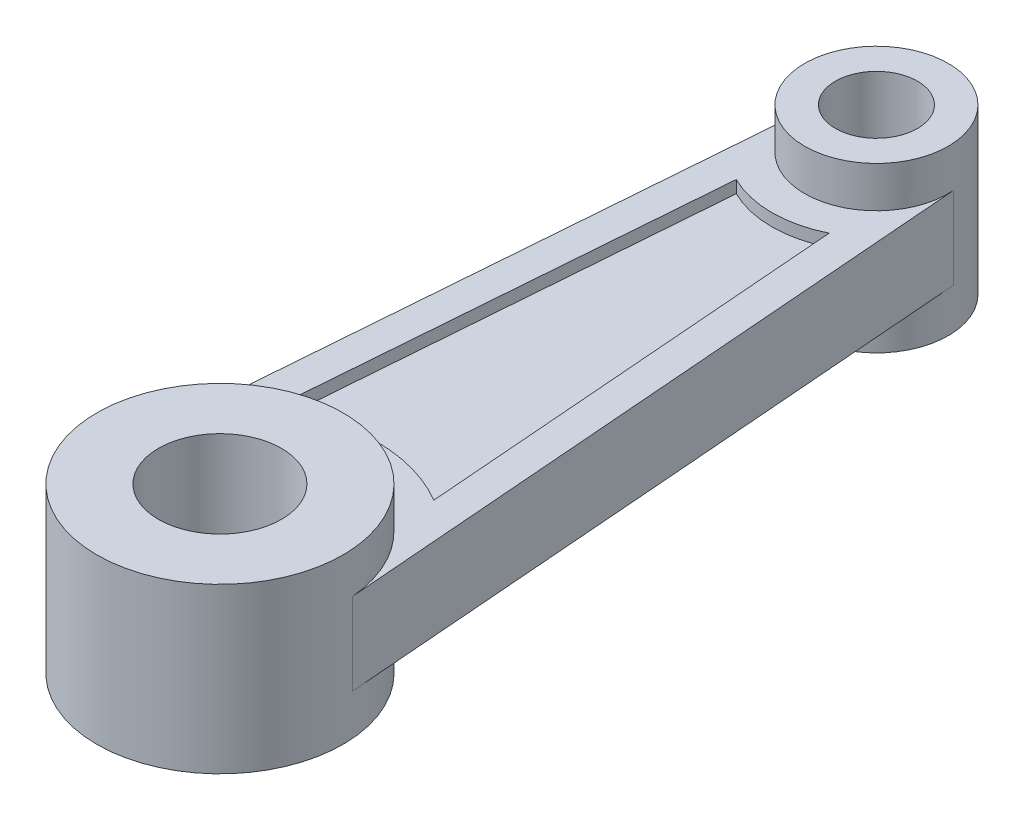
from build123d import *

# Parameters (mm, degrees)
CROQUIS1_R       = 30
CROQUIS1_R_2     = 15
EXTRUIR1_DEPTH   = 20
CROQUIS1_R_3     = 17.5
EXTRUIR1_2_DEPTH = 20
EXTRUIR2_DEPTH   = 10
CROQUIS2_R       = 10
EXTRUIR3_DEPTH   = 185.407836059
EXTRUIR4_DEPTH   = 3


with BuildPart() as part:
    # Croquis1 → Extruir1 (new, symmetric)
    with BuildSketch(Plane(origin=(0, 0, 0), x_dir=(1, 0, 0), z_dir=(0, 1, 0))):
        with Locations(Location((0, 0, 0), (0, 0, 270))):
            Circle(CROQUIS1_R)
        with Locations(Location((0, 0, 0), (0, 0, 270))):
            Circle(CROQUIS1_R_2, mode=Mode.SUBTRACT)
    extrude(amount=EXTRUIR1_DEPTH, both=True)



with BuildPart() as body_2:
    # Croquis1 → Extruir1 2 (new, symmetric)
    with BuildSketch(Plane(origin=(0, 0, 0), x_dir=(1, 0, 0), z_dir=(0, 1, 0))):
        with Locations(Location((0, 160, 0), (0, 0, 270))):
            Circle(CROQUIS1_R_3)
    extrude(amount=EXTRUIR1_2_DEPTH, both=True)


with BuildPart() as part_1:
    add(part.part)

    add(body_2.part)  # Extruir2 merges body 2
    # Croquis1_3 → Extruir2 (add, symmetric)
    with BuildSketch(Plane(origin=(0, 0, 0), x_dir=(1, 0, 0), z_dir=(0, 1, 0))):
        with BuildLine():
            Line((29.908307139, 2.34375), (17.446512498, 161.3671875))
            ThreePointArc((17.446512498, 161.3671875), (17.486623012, 160.684116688), (17.5, 160))
            ThreePointArc((17.5, 160), (12.374368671, 147.625631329), (0, 142.5))
            Line((0, 142.5), (0, 30))
            ThreePointArc((0, 30), (20.367713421, 22.026262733), (29.908307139, 2.34375))
        make_face()
        with BuildLine():
            ThreePointArc((0, 142.5), (-12.848653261, 148.118833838), (-17.446512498, 161.3671875))
            Line((-17.446512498, 161.3671875), (-29.908307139, 2.34375))
            ThreePointArc((-29.908307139, 2.34375), (-20.367713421, 22.026262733), (0, 30))
            Line((0, 30), (0, 142.5))
        make_face()
    extrude(amount=EXTRUIR2_DEPTH, both=True)

    # Croquis2 → Extruir3 (cut, through all)
    with BuildSketch(Plane(origin=(0, 20, 0), x_dir=(1, 0, 0), z_dir=(0, 1, 0))):
        with Locations(Location((0, 160, 0), (0, 0, 270))):
            Circle(CROQUIS2_R)
    extrude(amount=-EXTRUIR3_DEPTH, mode=Mode.SUBTRACT)

    # Croquis3 → Extruir4 (cut)
    with BuildSketch(Plane(origin=(0, 10, 0), x_dir=(1, 0, 0), z_dir=(0, 1, 0))):
        with BuildLine():
            Line((-11.31973886, 137.150196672), (-19.512143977, 32.60791679))
            ThreePointArc((-19.512143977, 32.60791679), (0, 38), (19.512143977, 32.60791679))
            Line((19.512143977, 32.60791679), (11.31973886, 137.150196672))
            ThreePointArc((11.31973886, 137.150196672), (0, 134.5), (-11.31973886, 137.150196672))
        make_face()
    extruir4 = extrude(amount=-EXTRUIR4_DEPTH, mode=Mode.SUBTRACT)

    # Simetr_a1: Extruir4 across plane
    add(extruir4.mirror(Plane.ZX), mode=Mode.SUBTRACT)


solid = part_1.part
